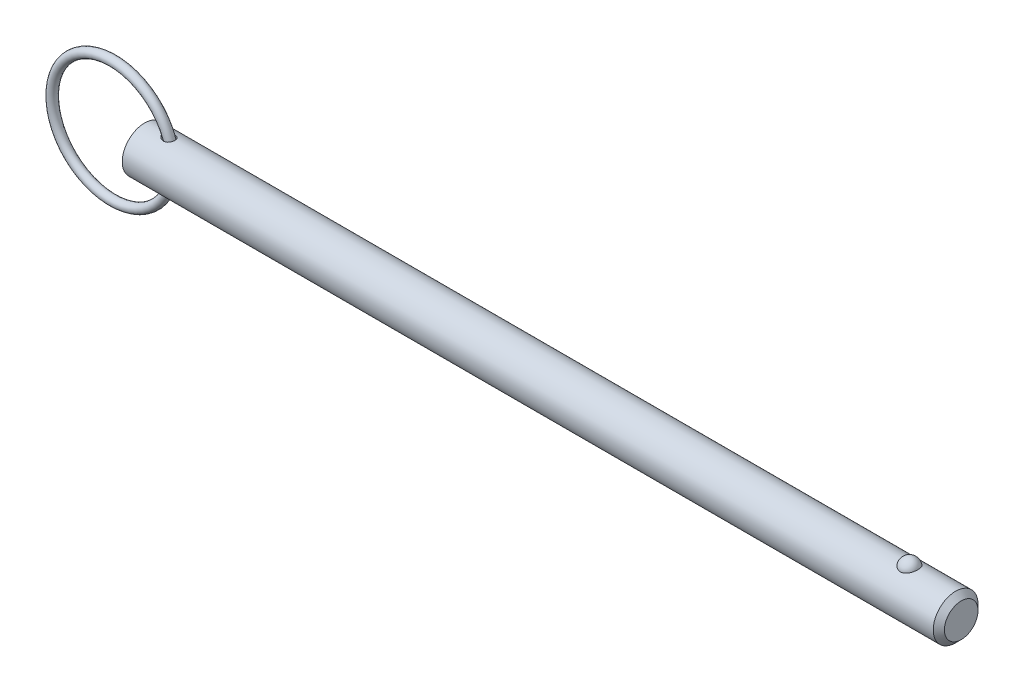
ISO-10303-21;
HEADER;
FILE_DESCRIPTION(('STEP AP214'),'2;1');
FILE_NAME('part.step','',(''),(''),'','','');
FILE_SCHEMA(('AUTOMOTIVE_DESIGN { 1 0 10303 214 1 1 1 1 }'));
ENDSEC;
DATA;
#1=APPLICATION_CONTEXT('core data for automotive mechanical design processes');
#2=APPLICATION_PROTOCOL_DEFINITION('international standard','automotive_design',2000,#1);
#3=PRODUCT_CONTEXT('',#1,'mechanical');
#4=PRODUCT('Part','Part','',(#3));
#5=PRODUCT_RELATED_PRODUCT_CATEGORY('part','',(#4));
#6=PRODUCT_DEFINITION_FORMATION('','',#4);
#7=PRODUCT_DEFINITION_CONTEXT('part definition',#1,'design');
#8=PRODUCT_DEFINITION('design','',#6,#7);
#9=PRODUCT_DEFINITION_SHAPE('','',#8);
#10=(LENGTH_UNIT() NAMED_UNIT(*) SI_UNIT(.MILLI.,.METRE.));
#11=(NAMED_UNIT(*) PLANE_ANGLE_UNIT() SI_UNIT($,.RADIAN.));
#12=(NAMED_UNIT(*) SI_UNIT($,.STERADIAN.) SOLID_ANGLE_UNIT());
#13=UNCERTAINTY_MEASURE_WITH_UNIT(LENGTH_MEASURE(1.E-05),#10,'distance_accuracy_value','');
#14=(GEOMETRIC_REPRESENTATION_CONTEXT(3) GLOBAL_UNCERTAINTY_ASSIGNED_CONTEXT((#13)) GLOBAL_UNIT_ASSIGNED_CONTEXT((#10,
#11,#12)) REPRESENTATION_CONTEXT('',''));
#15=CARTESIAN_POINT('',(0.,0.,0.));
#16=DIRECTION('',(0.,0.,1.));
#17=DIRECTION('',(1.,0.,0.));
#18=AXIS2_PLACEMENT_3D('',#15,#16,#17);
#19=CARTESIAN_POINT('',(-6.70471658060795,0.,0.));
#20=DIRECTION('',(0.,0.,1.));
#21=DIRECTION('',(1.,0.,0.));
#22=AXIS2_PLACEMENT_3D('',#19,#20,#21);
#23=TOROIDAL_SURFACE('',#22,12.7,0.940000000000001);
#24=CARTESIAN_POINT('',(6.93528341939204,0.,0.));
#25=VERTEX_POINT('',#24);
#26=VERTEX_LOOP('',#25);
#27=FACE_BOUND('',#26,.T.);
#28=ADVANCED_FACE('P0_F12',(#27),#23,.T.);
#29=CLOSED_SHELL('',(#28));
#30=MANIFOLD_SOLID_BREP('P0_B1',#29);
#31=CARTESIAN_POINT('',(0.,0.,0.));
#32=DIRECTION('',(1.,0.,0.));
#33=DIRECTION('',(0.,0.,-1.));
#34=AXIS2_PLACEMENT_3D('',#31,#32,#33);
#35=CYLINDRICAL_SURFACE('',#34,4.7);
#36=CARTESIAN_POINT('',(4.16378072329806,4.63584137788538,-0.773934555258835));
#37=CARTESIAN_POINT('',(4.22041228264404,4.62659903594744,-0.829297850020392));
#38=CARTESIAN_POINT('',(4.28206987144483,4.61719767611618,-0.87952289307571));
#39=CARTESIAN_POINT('',(4.41303152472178,4.59925351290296,-0.968997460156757));
#40=CARTESIAN_POINT('',(4.48234424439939,4.59071170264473,-1.00823437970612));
#41=CARTESIAN_POINT('',(4.62650734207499,4.5755493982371,-1.07495006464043));
#42=CARTESIAN_POINT('',(4.70135029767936,4.56892638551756,-1.10244426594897));
#43=CARTESIAN_POINT('',(4.85470490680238,4.55848940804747,-1.14483874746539));
#44=CARTESIAN_POINT('',(4.93321503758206,4.55467428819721,-1.15974420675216));
#45=CARTESIAN_POINT('',(5.09197970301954,4.55051176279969,-1.17597559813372));
#46=CARTESIAN_POINT('',(5.17223836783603,4.55017372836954,-1.17726483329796));
#47=CARTESIAN_POINT('',(5.33159446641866,4.55326696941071,-1.16524823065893));
#48=CARTESIAN_POINT('',(5.41069268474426,4.55669556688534,-1.15195276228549));
#49=CARTESIAN_POINT('',(5.55698758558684,4.56647801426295,-1.11249214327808));
#50=CARTESIAN_POINT('',(5.62458628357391,4.57250771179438,-1.08773548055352));
#51=CARTESIAN_POINT('',(5.7539770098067,4.58665356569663,-1.02644632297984));
#52=CARTESIAN_POINT('',(5.81577171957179,4.59476875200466,-0.989919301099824));
#53=CARTESIAN_POINT('',(5.92681484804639,4.61135052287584,-0.90939126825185));
#54=CARTESIAN_POINT('',(5.97666790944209,4.61973919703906,-0.866204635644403));
#55=CARTESIAN_POINT('',(6.06817854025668,4.63643253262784,-0.771868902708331));
#56=CARTESIAN_POINT('',(6.10983710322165,4.64473720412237,-0.720720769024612));
#57=CARTESIAN_POINT('',(6.18318089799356,4.660174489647,-0.612928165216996));
#58=CARTESIAN_POINT('',(6.21503150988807,4.66732544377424,-0.55639864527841));
#59=CARTESIAN_POINT('',(6.26900210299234,4.67985590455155,-0.438689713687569));
#60=CARTESIAN_POINT('',(6.29112194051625,4.68523538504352,-0.377510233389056));
#61=CARTESIAN_POINT('',(6.3252384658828,4.6936733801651,-0.251831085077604));
#62=CARTESIAN_POINT('',(6.33717189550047,4.69671737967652,-0.187313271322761));
#63=CARTESIAN_POINT('',(6.35042407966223,4.70010386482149,-0.0571258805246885));
#64=CARTESIAN_POINT('',(6.3517424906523,4.70044626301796,0.00854373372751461));
#65=CARTESIAN_POINT('',(6.34371729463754,4.69838816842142,0.139481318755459));
#66=CARTESIAN_POINT('',(6.33432596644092,4.69597539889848,0.204746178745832));
#67=CARTESIAN_POINT('',(6.30500866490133,4.68864655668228,0.332720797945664));
#68=CARTESIAN_POINT('',(6.28508259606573,4.68373046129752,0.395430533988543));
#69=CARTESIAN_POINT('',(6.23516511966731,4.67193431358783,0.516455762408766));
#70=CARTESIAN_POINT('',(6.20518126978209,4.66505573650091,0.574774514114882));
#71=CARTESIAN_POINT('',(6.1358631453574,4.65009270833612,0.685387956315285));
#72=CARTESIAN_POINT('',(6.09652950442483,4.64200833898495,0.737683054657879));
#73=CARTESIAN_POINT('',(6.00979078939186,4.62559001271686,0.834455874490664));
#74=CARTESIAN_POINT('',(5.96243625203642,4.61725787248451,0.878979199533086));
#75=CARTESIAN_POINT('',(5.86079843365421,4.60122574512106,0.959378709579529));
#76=CARTESIAN_POINT('',(5.80651591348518,4.59352568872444,0.995255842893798));
#77=CARTESIAN_POINT('',(5.69277386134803,4.57961669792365,1.05741527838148));
#78=CARTESIAN_POINT('',(5.63333134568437,4.57340309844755,1.08372773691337));
#79=CARTESIAN_POINT('',(5.5108424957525,4.56305640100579,1.12650026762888));
#80=CARTESIAN_POINT('',(5.44779577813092,4.55892352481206,1.14295928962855));
#81=CARTESIAN_POINT('',(5.3179566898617,4.55299444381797,1.1663590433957));
#82=CARTESIAN_POINT('',(5.25110869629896,4.55127026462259,1.17300670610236));
#83=CARTESIAN_POINT('',(5.11716812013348,4.55043953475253,1.17622268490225));
#84=CARTESIAN_POINT('',(5.05007546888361,4.55133378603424,1.17278791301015));
#85=CARTESIAN_POINT('',(4.91166083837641,4.55569951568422,1.15571913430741));
#86=CARTESIAN_POINT('',(4.84044690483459,4.55937764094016,1.1412666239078));
#87=CARTESIAN_POINT('',(4.70108819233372,4.56903562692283,1.10196123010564));
#88=CARTESIAN_POINT('',(4.63294574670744,4.57501720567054,1.07710058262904));
#89=CARTESIAN_POINT('',(4.4947730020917,4.58927184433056,1.01474439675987));
#90=CARTESIAN_POINT('',(4.42520748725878,4.59771156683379,0.976252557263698));
#91=CARTESIAN_POINT('',(4.29354165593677,4.61552030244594,0.888246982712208));
#92=CARTESIAN_POINT('',(4.23143936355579,4.62488906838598,0.838736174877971));
#93=CARTESIAN_POINT('',(4.12609666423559,4.64192969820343,0.738015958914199));
#94=CARTESIAN_POINT('',(4.08142630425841,4.64963595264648,0.68830869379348));
#95=CARTESIAN_POINT('',(4.0008117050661,4.66411457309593,0.582144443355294));
#96=CARTESIAN_POINT('',(3.96485623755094,4.6708881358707,0.525696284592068));
#97=CARTESIAN_POINT('',(3.90818393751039,4.68183565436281,0.415917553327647));
#98=CARTESIAN_POINT('',(3.88599581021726,4.68624644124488,0.363372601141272));
#99=CARTESIAN_POINT('',(3.85055971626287,4.693376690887,0.255230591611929));
#100=CARTESIAN_POINT('',(3.83730635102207,4.69609717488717,0.199635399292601));
#101=CARTESIAN_POINT('',(3.82058225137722,4.69954043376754,0.0867104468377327));
#102=CARTESIAN_POINT('',(3.81714632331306,4.70025610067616,0.0293752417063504));
#103=CARTESIAN_POINT('',(3.8204140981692,4.69957935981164,-0.0849928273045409));
#104=CARTESIAN_POINT('',(3.82711802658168,4.69818690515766,-0.14202568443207));
#105=CARTESIAN_POINT('',(3.84950128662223,4.69360426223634,-0.250744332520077));
#106=CARTESIAN_POINT('',(3.8646389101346,4.69052274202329,-0.302548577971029));
#107=CARTESIAN_POINT('',(3.90261190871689,4.68295207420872,-0.403121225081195));
#108=CARTESIAN_POINT('',(3.92544863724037,4.67846267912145,-0.451889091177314));
#109=CARTESIAN_POINT('',(3.97999306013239,4.6680441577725,-0.549522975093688));
#110=CARTESIAN_POINT('',(4.01228648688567,4.66202553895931,-0.598050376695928));
#111=CARTESIAN_POINT('',(4.08340845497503,4.64931397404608,-0.689954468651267));
#112=CARTESIAN_POINT('',(4.12224260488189,4.64262045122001,-0.733326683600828));
#113=CARTESIAN_POINT('',(4.16378072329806,4.63584137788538,-0.773934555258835));
#114=B_SPLINE_CURVE_WITH_KNOTS('',3,(#36,#37,#38,#39,#40,#41,#42,#43,#44,#45,#46,#47,#48,#49,
#50,#51,#52,#53,#54,#55,#56,#57,#58,#59,#60,#61,#62,#63,#64,#65,#66,#67,#68,#69,#70,#71,#72,#73,
#74,#75,#76,#77,#78,#79,#80,#81,#82,#83,#84,#85,#86,#87,#88,#89,#90,#91,#92,#93,#94,#95,#96,#97,
#98,#99,#100,#101,#102,#103,#104,#105,#106,#107,#108,#109,#110,#111,#112,#113),.UNSPECIFIED.,
.T.,.F.,(4,2,2,2,2,2,2,2,2,2,2,2,2,2,2,2,2,2,2,2,2,2,2,2,2,2,2,2,2,2,2,2,2,2,2,2,2,2,4),(0.,
0.238977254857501,0.478227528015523,0.717162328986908,0.955998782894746,1.19547875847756,
1.43478857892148,1.65034375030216,1.8657988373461,2.06429861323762,2.26277430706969,
2.45769248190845,2.65261353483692,2.848736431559,3.04486567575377,3.24187227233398,
3.43888065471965,3.6357413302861,3.83258866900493,4.02823898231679,4.22386782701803,
4.41887441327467,4.61390177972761,4.81464443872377,5.0154485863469,5.2328283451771,
5.45037055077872,5.68914354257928,5.92785317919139,6.12887730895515,6.32964104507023,
6.50053592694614,6.67132745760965,6.84272375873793,7.0141238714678,7.17560768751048,
7.33711990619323,7.5122540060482,7.68753905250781),.UNSPECIFIED.);
#115=CARTESIAN_POINT('',(4.16378072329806,4.63584137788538,-0.773934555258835));
#116=VERTEX_POINT('',#115);
#117=EDGE_CURVE('P1_E40',#116,#116,#114,.T.);
#118=ORIENTED_EDGE('',*,*,#117,.T.);
#119=EDGE_LOOP('',(#118));
#120=FACE_BOUND('',#119,.T.);
#121=CARTESIAN_POINT('',(170.275,0.,0.));
#122=DIRECTION('',(1.,0.,0.));
#123=DIRECTION('',(0.,0.,-1.));
#124=AXIS2_PLACEMENT_3D('',#121,#122,#123);
#125=CIRCLE('',#124,4.7);
#126=CARTESIAN_POINT('',(170.275,0.,-4.7));
#127=VERTEX_POINT('',#126);
#128=EDGE_CURVE('P1_E25',#127,#127,#125,.T.);
#129=ORIENTED_EDGE('',*,*,#128,.F.);
#130=EDGE_LOOP('',(#129));
#131=FACE_BOUND('',#130,.T.);
#132=CARTESIAN_POINT('',(0.,0.,0.));
#133=DIRECTION('',(1.,0.,0.));
#134=DIRECTION('',(0.,0.,-1.));
#135=AXIS2_PLACEMENT_3D('',#132,#133,#134);
#136=CIRCLE('',#135,4.7);
#137=CARTESIAN_POINT('',(0.,0.,-4.7));
#138=VERTEX_POINT('',#137);
#139=EDGE_CURVE('P1_E9',#138,#138,#136,.T.);
#140=ORIENTED_EDGE('',*,*,#139,.T.);
#141=EDGE_LOOP('',(#140));
#142=FACE_BOUND('',#141,.T.);
#143=CARTESIAN_POINT('',(160.58062830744,4.30387706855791,1.8885555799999));
#144=CARTESIAN_POINT('',(160.482813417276,4.30388592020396,1.88854684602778));
#145=CARTESIAN_POINT('',(160.384851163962,4.3073123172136,1.88078712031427));
#146=CARTESIAN_POINT('',(160.191662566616,4.32065009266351,1.84993192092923));
#147=CARTESIAN_POINT('',(160.096443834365,4.33057798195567,1.82679740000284));
#148=CARTESIAN_POINT('',(159.91181755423,4.35574577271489,1.76594245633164));
#149=CARTESIAN_POINT('',(159.822395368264,4.37097162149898,1.72826059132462));
#150=CARTESIAN_POINT('',(159.651390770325,4.40507782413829,1.63937301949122));
#151=CARTESIAN_POINT('',(159.569805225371,4.4239567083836,1.58817274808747));
#152=CARTESIAN_POINT('',(159.413901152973,4.46404088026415,1.47181116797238));
#153=CARTESIAN_POINT('',(159.339875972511,4.48529915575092,1.40627540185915));
#154=CARTESIAN_POINT('',(159.203536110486,4.52748512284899,1.26387806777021));
#155=CARTESIAN_POINT('',(159.141224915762,4.54841271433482,1.18701313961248));
#156=CARTESIAN_POINT('',(159.027072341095,4.58876216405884,1.02025841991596));
#157=CARTESIAN_POINT('',(158.975811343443,4.60807744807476,0.929944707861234));
#158=CARTESIAN_POINT('',(158.88842456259,4.6421320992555,0.741468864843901));
#159=CARTESIAN_POINT('',(158.852299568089,4.65687122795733,0.643306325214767));
#160=CARTESIAN_POINT('',(158.795671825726,4.68038485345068,0.440967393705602));
#161=CARTESIAN_POINT('',(158.775304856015,4.68910744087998,0.336746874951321));
#162=CARTESIAN_POINT('',(158.751132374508,4.69949255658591,0.126059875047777));
#163=CARTESIAN_POINT('',(158.747326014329,4.70115544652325,0.0195935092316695));
#164=CARTESIAN_POINT('',(158.756308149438,4.69727256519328,-0.191500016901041));
#165=CARTESIAN_POINT('',(158.768941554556,4.69179416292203,-0.296135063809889));
#166=CARTESIAN_POINT('',(158.810276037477,4.67429351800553,-0.501612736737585));
#167=CARTESIAN_POINT('',(158.838977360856,4.66227117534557,-0.602455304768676));
#168=CARTESIAN_POINT('',(158.911928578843,4.63286427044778,-0.797707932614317));
#169=CARTESIAN_POINT('',(158.956204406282,4.61547077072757,-0.892106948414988));
#170=CARTESIAN_POINT('',(159.059407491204,4.5770990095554,-1.07173134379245));
#171=CARTESIAN_POINT('',(159.118336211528,4.55612039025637,-1.15695580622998));
#172=CARTESIAN_POINT('',(159.250216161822,4.51257918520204,-1.31664252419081));
#173=CARTESIAN_POINT('',(159.323286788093,4.49000423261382,-1.39100294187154));
#174=CARTESIAN_POINT('',(159.481478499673,4.44594443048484,-1.5259854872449));
#175=CARTESIAN_POINT('',(159.566599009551,4.4244595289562,-1.58660827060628));
#176=CARTESIAN_POINT('',(159.745267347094,4.38543655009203,-1.69145998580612));
#177=CARTESIAN_POINT('',(159.838651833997,4.3678388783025,-1.73594433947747));
#178=CARTESIAN_POINT('',(160.03242205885,4.33829418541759,-1.80852276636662));
#179=CARTESIAN_POINT('',(160.132805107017,4.32634500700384,-1.8366230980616));
#180=CARTESIAN_POINT('',(160.33228752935,4.31005085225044,-1.87453136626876));
#181=CARTESIAN_POINT('',(160.431196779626,4.30535309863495,-1.88518956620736));
#182=CARTESIAN_POINT('',(160.629521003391,4.30299844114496,-1.89055986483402));
#183=CARTESIAN_POINT('',(160.728935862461,4.30534000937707,-1.88527542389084));
#184=CARTESIAN_POINT('',(160.92186386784,4.31657737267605,-1.85939299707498));
#185=CARTESIAN_POINT('',(161.015462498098,4.32524571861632,-1.8393262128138));
#186=CARTESIAN_POINT('',(161.197783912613,4.3479151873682,-1.78507441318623));
#187=CARTESIAN_POINT('',(161.286506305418,4.36191673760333,-1.75088826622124));
#188=CARTESIAN_POINT('',(161.458694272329,4.39411605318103,-1.66845234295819));
#189=CARTESIAN_POINT('',(161.542008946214,4.41239631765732,-1.61992036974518));
#190=CARTESIAN_POINT('',(161.699399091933,4.45109244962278,-1.51034589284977));
#191=CARTESIAN_POINT('',(161.773472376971,4.47150882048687,-1.44930043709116));
#192=CARTESIAN_POINT('',(161.914405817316,4.51353865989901,-1.31275193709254));
#193=CARTESIAN_POINT('',(161.980701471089,4.53515983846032,-1.23666813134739));
#194=CARTESIAN_POINT('',(162.100069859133,4.57635116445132,-1.07425533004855));
#195=CARTESIAN_POINT('',(162.15314024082,4.59592094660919,-0.987924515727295));
#196=CARTESIAN_POINT('',(162.246443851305,4.63161819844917,-0.804428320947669));
#197=CARTESIAN_POINT('',(162.286229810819,4.64762063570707,-0.70701060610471));
#198=CARTESIAN_POINT('',(162.349825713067,4.67374032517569,-0.506344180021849));
#199=CARTESIAN_POINT('',(162.373635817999,4.68385763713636,-0.403095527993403));
#200=CARTESIAN_POINT('',(162.404751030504,4.69716075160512,-0.193975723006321));
#201=CARTESIAN_POINT('',(162.412098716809,4.70036443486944,-0.0881120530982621));
#202=CARTESIAN_POINT('',(162.410261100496,4.6995691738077,0.123441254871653));
#203=CARTESIAN_POINT('',(162.401076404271,4.69557049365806,0.229130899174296));
#204=CARTESIAN_POINT('',(162.366492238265,4.68082941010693,0.436545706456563));
#205=CARTESIAN_POINT('',(162.341209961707,4.67013575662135,0.538293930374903));
#206=CARTESIAN_POINT('',(162.275050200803,4.64311776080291,0.735797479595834));
#207=CARTESIAN_POINT('',(162.234171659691,4.62679303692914,0.831552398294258));
#208=CARTESIAN_POINT('',(162.137286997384,4.5900271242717,1.01512750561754));
#209=CARTESIAN_POINT('',(162.081173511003,4.56955699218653,1.10288523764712));
#210=CARTESIAN_POINT('',(161.95510852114,4.52671789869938,1.26730106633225));
#211=CARTESIAN_POINT('',(161.885157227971,4.50434896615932,1.3439593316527));
#212=CARTESIAN_POINT('',(161.732724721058,4.46008413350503,1.48428028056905));
#213=CARTESIAN_POINT('',(161.650209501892,4.43818970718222,1.54790656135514));
#214=CARTESIAN_POINT('',(161.474735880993,4.39746476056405,1.66008504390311));
#215=CARTESIAN_POINT('',(161.381773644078,4.37863537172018,1.70863168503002));
#216=CARTESIAN_POINT('',(161.191099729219,4.34688784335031,1.78783023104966));
#217=CARTESIAN_POINT('',(161.093629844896,4.33380220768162,1.81899757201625));
#218=CARTESIAN_POINT('',(160.894405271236,4.31435159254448,1.86467392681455));
#219=CARTESIAN_POINT('',(160.792663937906,4.30796708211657,1.87923136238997));
#220=CARTESIAN_POINT('',(160.65391360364,4.30435030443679,1.88747378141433));
#221=CARTESIAN_POINT('',(160.61728130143,4.30387375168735,1.88855885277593));
#222=CARTESIAN_POINT('',(160.58062830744,4.30387706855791,1.8885555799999));
#223=B_SPLINE_CURVE_WITH_KNOTS('',3,(#143,#144,#145,#146,#147,#148,#149,#150,#151,#152,#153,
#154,#155,#156,#157,#158,#159,#160,#161,#162,#163,#164,#165,#166,#167,#168,#169,#170,#171,#172,
#173,#174,#175,#176,#177,#178,#179,#180,#181,#182,#183,#184,#185,#186,#187,#188,#189,#190,#191,
#192,#193,#194,#195,#196,#197,#198,#199,#200,#201,#202,#203,#204,#205,#206,#207,#208,#209,#210,
#211,#212,#213,#214,#215,#216,#217,#218,#219,#220,#221,#222),.UNSPECIFIED.,.T.,.F.,(4,2,2,2,2,2,
2,2,2,2,2,2,2,2,2,2,2,2,2,2,2,2,2,2,2,2,2,2,2,2,2,2,2,2,2,2,2,2,2,4),(0.,0.293339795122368,
0.587427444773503,0.880740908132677,1.17393661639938,1.47597417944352,1.7781015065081,
2.09350493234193,2.40892479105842,2.72703308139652,3.04512507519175,3.36023788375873,
3.67535550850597,3.99100033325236,4.30667668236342,4.62514463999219,4.94359739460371,
5.25676407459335,5.56981105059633,5.86708641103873,6.16429725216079,6.45131888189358,
6.73836351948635,7.03148013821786,7.32466598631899,7.63288296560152,7.94115473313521,
8.25895074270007,8.57674352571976,8.89371340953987,9.21067166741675,9.52534839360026,
9.84004644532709,10.1570225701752,10.4739938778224,10.7918388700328,11.1098009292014,
11.4177488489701,11.7247967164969,11.8347163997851),.UNSPECIFIED.);
#224=CARTESIAN_POINT('',(160.58062830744,4.30387706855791,1.8885555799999));
#225=VERTEX_POINT('',#224);
#226=EDGE_CURVE('P1_E34',#225,#225,#223,.T.);
#227=ORIENTED_EDGE('',*,*,#226,.T.);
#228=EDGE_LOOP('',(#227));
#229=FACE_BOUND('',#228,.T.);
#230=CARTESIAN_POINT('',(4.16378072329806,-4.63584137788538,-0.773934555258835));
#231=CARTESIAN_POINT('',(4.11797605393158,-4.64331682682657,-0.729154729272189));
#232=CARTESIAN_POINT('',(4.07545237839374,-4.65068929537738,-0.681007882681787));
#233=CARTESIAN_POINT('',(3.99850919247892,-4.66454993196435,-0.578483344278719));
#234=CARTESIAN_POINT('',(3.96408464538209,-4.67103864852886,-0.524109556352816));
#235=CARTESIAN_POINT('',(3.90486465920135,-4.68247538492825,-0.409579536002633));
#236=CARTESIAN_POINT('',(3.88014787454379,-4.68741075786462,-0.349380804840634));
#237=CARTESIAN_POINT('',(3.84254060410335,-4.69500854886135,-0.225256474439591));
#238=CARTESIAN_POINT('',(3.82963753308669,-4.69767338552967,-0.161334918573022));
#239=CARTESIAN_POINT('',(3.81750619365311,-4.70018000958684,-0.0396774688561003));
#240=CARTESIAN_POINT('',(3.8168623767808,-4.70031401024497,0.0179134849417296));
#241=CARTESIAN_POINT('',(3.82570055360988,-4.69848615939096,0.132270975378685));
#242=CARTESIAN_POINT('',(3.83518142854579,-4.6965245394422,0.189037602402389));
#243=CARTESIAN_POINT('',(3.8627670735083,-4.69091189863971,0.296808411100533));
#244=CARTESIAN_POINT('',(3.88034293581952,-4.68736483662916,0.347956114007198));
#245=CARTESIAN_POINT('',(3.92293217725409,-4.67896699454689,0.446919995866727));
#246=CARTESIAN_POINT('',(3.94794743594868,-4.67411588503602,0.494735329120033));
#247=CARTESIAN_POINT('',(4.00723361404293,-4.66297432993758,0.590975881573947));
#248=CARTESIAN_POINT('',(4.04218787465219,-4.65658759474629,0.63896688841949));
#249=CARTESIAN_POINT('',(4.11850165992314,-4.64327412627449,0.729452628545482));
#250=CARTESIAN_POINT('',(4.15986486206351,-4.63634708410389,0.771944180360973));
#251=CARTESIAN_POINT('',(4.25563139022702,-4.62124878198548,0.858077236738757));
#252=CARTESIAN_POINT('',(4.3110472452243,-4.61307408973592,0.900593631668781));
#253=CARTESIAN_POINT('',(4.42760239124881,-4.59748077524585,0.977085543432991));
#254=CARTESIAN_POINT('',(4.48874590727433,-4.59006271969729,1.01105468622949));
#255=CARTESIAN_POINT('',(4.62409915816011,-4.5757760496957,1.07399161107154));
#256=CARTESIAN_POINT('',(4.69895162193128,-4.56912175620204,1.10163764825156));
#257=CARTESIAN_POINT('',(4.85238616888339,-4.55861611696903,1.14433682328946));
#258=CARTESIAN_POINT('',(4.93096882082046,-4.55476520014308,1.15938803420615));
#259=CARTESIAN_POINT('',(5.08983848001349,-4.55053674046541,1.17587995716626));
#260=CARTESIAN_POINT('',(5.17012835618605,-4.55016559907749,1.17729558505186));
#261=CARTESIAN_POINT('',(5.32956049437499,-4.55319561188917,1.16552635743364));
#262=CARTESIAN_POINT('',(5.40870366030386,-4.55659361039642,1.15235371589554));
#263=CARTESIAN_POINT('',(5.55512154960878,-4.56632591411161,1.11311448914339));
#264=CARTESIAN_POINT('',(5.62279525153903,-4.57233592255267,1.08845479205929));
#265=CARTESIAN_POINT('',(5.75235194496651,-4.58645252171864,1.02734156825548));
#266=CARTESIAN_POINT('',(5.81423750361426,-4.59455817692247,0.990893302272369));
#267=CARTESIAN_POINT('',(5.92544729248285,-4.61112960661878,0.910507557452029));
#268=CARTESIAN_POINT('',(5.9753775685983,-4.61951638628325,0.867388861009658));
#269=CARTESIAN_POINT('',(6.06705041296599,-4.63621447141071,0.773173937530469));
#270=CARTESIAN_POINT('',(6.10879399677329,-4.64452578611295,0.722078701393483));
#271=CARTESIAN_POINT('',(6.18230323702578,-4.65998194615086,0.614385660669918));
#272=CARTESIAN_POINT('',(6.21423602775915,-4.66714520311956,0.557904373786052));
#273=CARTESIAN_POINT('',(6.26837651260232,-4.67970630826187,0.440277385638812));
#274=CARTESIAN_POINT('',(6.29058407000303,-4.68510413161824,0.379131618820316));
#275=CARTESIAN_POINT('',(6.32487950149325,-4.69358284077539,0.253506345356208));
#276=CARTESIAN_POINT('',(6.33690441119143,-4.69664929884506,0.189008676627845));
#277=CARTESIAN_POINT('',(6.35034148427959,-4.70008248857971,0.05884554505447));
#278=CARTESIAN_POINT('',(6.35175330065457,-4.70044913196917,-0.00681995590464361));
#279=CARTESIAN_POINT('',(6.34391515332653,-4.69843881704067,-0.137767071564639));
#280=CARTESIAN_POINT('',(6.33461722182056,-4.69604951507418,-0.203045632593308));
#281=CARTESIAN_POINT('',(6.30548404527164,-4.68876413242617,-0.331063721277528));
#282=CARTESIAN_POINT('',(6.28564870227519,-4.68386802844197,-0.393803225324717));
#283=CARTESIAN_POINT('',(6.23590713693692,-4.67210599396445,-0.514904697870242));
#284=CARTESIAN_POINT('',(6.20600824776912,-4.66524149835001,-0.573269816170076));
#285=CARTESIAN_POINT('',(6.13685224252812,-4.65029918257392,-0.683989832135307));
#286=CARTESIAN_POINT('',(6.09759575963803,-4.6422214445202,-0.736345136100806));
#287=CARTESIAN_POINT('',(6.01099960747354,-4.62580793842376,-0.833250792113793));
#288=CARTESIAN_POINT('',(5.963710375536,-4.61747403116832,-0.877846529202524));
#289=CARTESIAN_POINT('',(5.8621900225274,-4.60143050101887,-0.958399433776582));
#290=CARTESIAN_POINT('',(5.80795966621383,-4.59372080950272,-0.99435755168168));
#291=CARTESIAN_POINT('',(5.69431062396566,-4.57978661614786,-1.05668157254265));
#292=CARTESIAN_POINT('',(5.63490936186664,-4.57355737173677,-1.08307825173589));
#293=CARTESIAN_POINT('',(5.51248756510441,-4.56317492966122,-1.12602176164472));
#294=CARTESIAN_POINT('',(5.44946662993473,-4.55902196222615,-1.1425675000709));
#295=CARTESIAN_POINT('',(5.31967752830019,-4.55305083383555,-1.16613984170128));
#296=CARTESIAN_POINT('',(5.25285368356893,-4.55130415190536,-1.17287534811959));
#297=CARTESIAN_POINT('',(5.11894995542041,-4.55042807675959,-1.17626714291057));
#298=CARTESIAN_POINT('',(5.05187000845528,-4.55129938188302,-1.17292074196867));
#299=CARTESIAN_POINT('',(4.91348721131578,-4.55561850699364,-1.15603764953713));
#300=CARTESIAN_POINT('',(4.84229084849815,-4.55927235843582,-1.14168541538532));
#301=CARTESIAN_POINT('',(4.70293860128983,-4.56888540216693,-1.10258192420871));
#302=CARTESIAN_POINT('',(4.63478566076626,-4.57484677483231,-1.07782082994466));
#303=CARTESIAN_POINT('',(4.49401200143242,-4.58932889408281,-1.01452290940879));
#304=CARTESIAN_POINT('',(4.42204931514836,-4.59808779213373,-0.974568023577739));
#305=CARTESIAN_POINT('',(4.28620227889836,-4.61656806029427,-0.882881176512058));
#306=CARTESIAN_POINT('',(4.22231268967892,-4.62628879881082,-0.831156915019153));
#307=CARTESIAN_POINT('',(4.16378072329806,-4.63584137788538,-0.773934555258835));
#308=B_SPLINE_CURVE_WITH_KNOTS('',3,(#230,#231,#232,#233,#234,#235,#236,#237,#238,#239,#240,
#241,#242,#243,#244,#245,#246,#247,#248,#249,#250,#251,#252,#253,#254,#255,#256,#257,#258,#259,
#260,#261,#262,#263,#264,#265,#266,#267,#268,#269,#270,#271,#272,#273,#274,#275,#276,#277,#278,
#279,#280,#281,#282,#283,#284,#285,#286,#287,#288,#289,#290,#291,#292,#293,#294,#295,#296,#297,
#298,#299,#300,#301,#302,#303,#304,#305,#306,#307),.UNSPECIFIED.,.T.,.F.,(4,2,2,2,2,2,2,2,2,2,2,
2,2,2,2,2,2,2,2,2,2,2,2,2,2,2,2,2,2,2,2,2,2,2,2,2,2,2,4),(0.,0.193263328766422,
0.386406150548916,0.581083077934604,0.775552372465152,0.947410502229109,1.11924964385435,
1.28117818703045,1.44314767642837,1.62161944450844,1.80019400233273,2.01034324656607,
2.22064874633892,2.45975127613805,2.69889038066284,2.93846932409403,3.1778478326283,
3.39350806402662,3.6090721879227,3.8076122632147,4.00612769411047,4.20104508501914,
4.39596521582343,4.59208201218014,4.78820522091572,4.98521027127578,5.18221715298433,
5.37908078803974,5.57593110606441,5.7715882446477,5.96722384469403,6.1622240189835,
6.35724581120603,6.55794420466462,6.75869613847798,6.97596054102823,7.1934307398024,
7.44055547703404,7.68751900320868),.UNSPECIFIED.);
#309=CARTESIAN_POINT('',(4.16378072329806,-4.63584137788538,-0.773934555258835));
#310=VERTEX_POINT('',#309);
#311=EDGE_CURVE('P1_E17',#310,#310,#308,.T.);
#312=ORIENTED_EDGE('',*,*,#311,.T.);
#313=EDGE_LOOP('',(#312));
#314=FACE_BOUND('',#313,.T.);
#315=ADVANCED_FACE('P1_F13',(#120,#131,#142,#229,#314),#35,.T.);
#316=CARTESIAN_POINT('',(0.,0.,0.));
#317=DIRECTION('',(-1.,0.,0.));
#318=DIRECTION('',(0.,0.,1.));
#319=AXIS2_PLACEMENT_3D('',#316,#317,#318);
#320=PLANE('',#319);
#321=ORIENTED_EDGE('',*,*,#139,.F.);
#322=EDGE_LOOP('',(#321));
#323=FACE_BOUND('',#322,.T.);
#324=ADVANCED_FACE('P1_F15',(#323),#320,.T.);
#325=CARTESIAN_POINT('',(171.45,0.,0.));
#326=DIRECTION('',(-1.,0.,0.));
#327=DIRECTION('',(0.,0.,1.));
#328=AXIS2_PLACEMENT_3D('',#325,#326,#327);
#329=CONICAL_SURFACE('',#328,3.52500000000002,0.785398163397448);
#330=ORIENTED_EDGE('',*,*,#128,.T.);
#331=EDGE_LOOP('',(#330));
#332=FACE_BOUND('',#331,.T.);
#333=CARTESIAN_POINT('',(171.45,0.,0.));
#334=DIRECTION('',(1.,0.,0.));
#335=DIRECTION('',(0.,0.,-1.));
#336=AXIS2_PLACEMENT_3D('',#333,#334,#335);
#337=CIRCLE('',#336,3.52500000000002);
#338=CARTESIAN_POINT('',(171.45,0.,-3.52500000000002));
#339=VERTEX_POINT('',#338);
#340=EDGE_CURVE('P1_E30',#339,#339,#337,.T.);
#341=ORIENTED_EDGE('',*,*,#340,.F.);
#342=EDGE_LOOP('',(#341));
#343=FACE_BOUND('',#342,.T.);
#344=ADVANCED_FACE('P1_F55',(#332,#343),#329,.T.);
#345=CARTESIAN_POINT('',(171.45,3.52500000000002,0.));
#346=DIRECTION('',(1.,0.,0.));
#347=DIRECTION('',(0.,0.,-1.));
#348=AXIS2_PLACEMENT_3D('',#345,#346,#347);
#349=PLANE('',#348);
#350=ORIENTED_EDGE('',*,*,#340,.T.);
#351=EDGE_LOOP('',(#350));
#352=FACE_BOUND('',#351,.T.);
#353=ADVANCED_FACE('P1_F51',(#352),#349,.T.);
#354=CARTESIAN_POINT('',(160.58062830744,4.23,0.));
#355=DIRECTION('',(-1.,0.,0.));
#356=DIRECTION('',(0.,1.,0.));
#357=AXIS2_PLACEMENT_3D('',#354,#355,#356);
#358=SPHERICAL_SURFACE('',#357,1.89000000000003);
#359=ORIENTED_EDGE('',*,*,#226,.F.);
#360=EDGE_LOOP('',(#359));
#361=FACE_BOUND('',#360,.T.);
#362=ADVANCED_FACE('P1_F46',(#361),#358,.T.);
#363=CARTESIAN_POINT('',(-6.70471658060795,0.,0.));
#364=DIRECTION('',(0.,0.,1.));
#365=DIRECTION('',(1.,0.,0.));
#366=AXIS2_PLACEMENT_3D('',#363,#364,#365);
#367=TOROIDAL_SURFACE('',#366,12.7,1.175);
#368=ORIENTED_EDGE('',*,*,#311,.F.);
#369=EDGE_LOOP('',(#368));
#370=FACE_BOUND('',#369,.T.);
#371=ORIENTED_EDGE('',*,*,#117,.F.);
#372=EDGE_LOOP('',(#371));
#373=FACE_BOUND('',#372,.T.);
#374=ADVANCED_FACE('P1_F50',(#370,#373),#367,.F.);
#375=CLOSED_SHELL('',(#315,#324,#344,#353,#362,#374));
#376=MANIFOLD_SOLID_BREP('P1_B1',#375);
#377=ADVANCED_BREP_SHAPE_REPRESENTATION('',(#18,#30,#376),#14);
#378=SHAPE_DEFINITION_REPRESENTATION(#9,#377);
ENDSEC;
END-ISO-10303-21;
